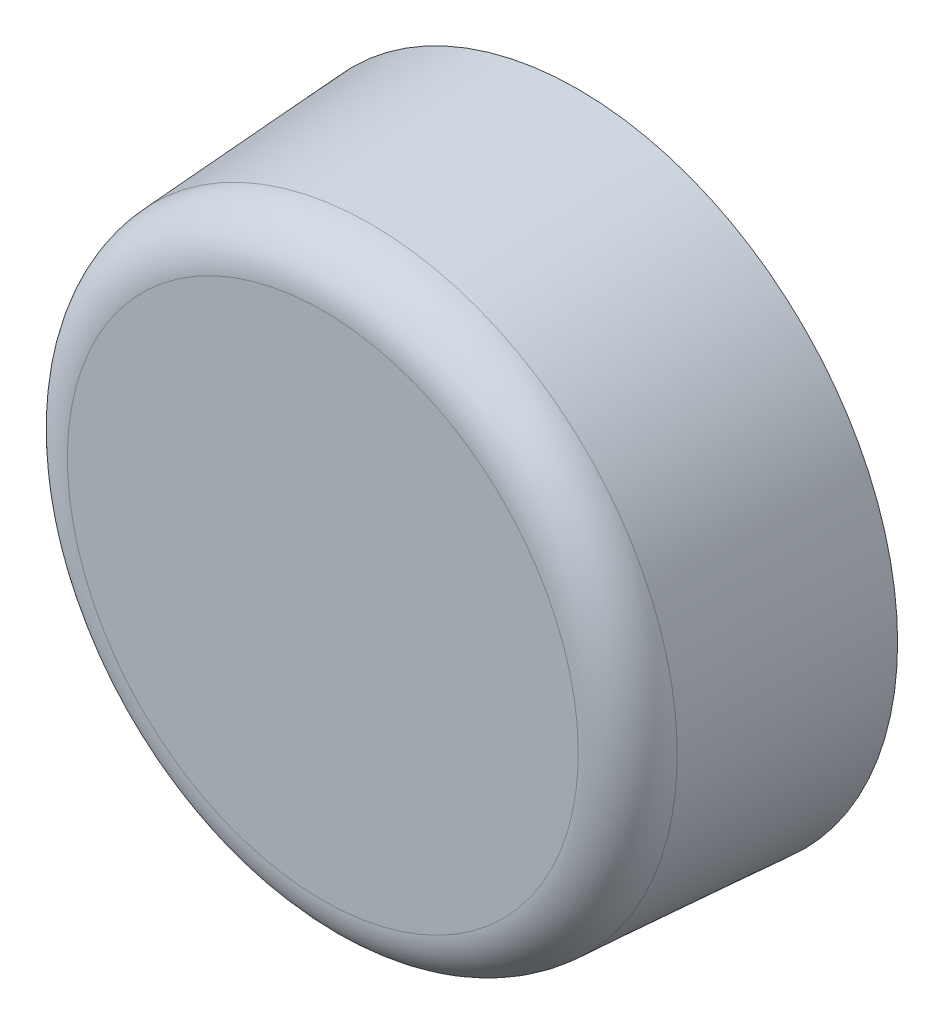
ISO-10303-21;
HEADER;
FILE_DESCRIPTION(('STEP AP214'),'2;1');
FILE_NAME('part.step','',(''),(''),'','','');
FILE_SCHEMA(('AUTOMOTIVE_DESIGN { 1 0 10303 214 1 1 1 1 }'));
ENDSEC;
DATA;
#1=APPLICATION_CONTEXT('core data for automotive mechanical design processes');
#2=APPLICATION_PROTOCOL_DEFINITION('international standard','automotive_design',2000,#1);
#3=PRODUCT_CONTEXT('',#1,'mechanical');
#4=PRODUCT('Part','Part','',(#3));
#5=PRODUCT_RELATED_PRODUCT_CATEGORY('part','',(#4));
#6=PRODUCT_DEFINITION_FORMATION('','',#4);
#7=PRODUCT_DEFINITION_CONTEXT('part definition',#1,'design');
#8=PRODUCT_DEFINITION('design','',#6,#7);
#9=PRODUCT_DEFINITION_SHAPE('','',#8);
#10=(LENGTH_UNIT() NAMED_UNIT(*) SI_UNIT(.MILLI.,.METRE.));
#11=(NAMED_UNIT(*) PLANE_ANGLE_UNIT() SI_UNIT($,.RADIAN.));
#12=(NAMED_UNIT(*) SI_UNIT($,.STERADIAN.) SOLID_ANGLE_UNIT());
#13=UNCERTAINTY_MEASURE_WITH_UNIT(LENGTH_MEASURE(1.E-05),#10,'distance_accuracy_value','');
#14=(GEOMETRIC_REPRESENTATION_CONTEXT(3) GLOBAL_UNCERTAINTY_ASSIGNED_CONTEXT((#13)) GLOBAL_UNIT_ASSIGNED_CONTEXT((#10,
#11,#12)) REPRESENTATION_CONTEXT('',''));
#15=CARTESIAN_POINT('',(0.,0.,0.));
#16=DIRECTION('',(0.,0.,1.));
#17=DIRECTION('',(1.,0.,0.));
#18=AXIS2_PLACEMENT_3D('',#15,#16,#17);
#19=CARTESIAN_POINT('',(0.,0.,20.));
#20=DIRECTION('',(0.,0.,1.));
#21=DIRECTION('',(0.,-1.,0.));
#22=AXIS2_PLACEMENT_3D('',#19,#20,#21);
#23=CYLINDRICAL_SURFACE('',#22,22.5);
#24=CARTESIAN_POINT('',(0.,0.,0.));
#25=DIRECTION('',(0.,0.,1.));
#26=DIRECTION('',(0.,-1.,0.));
#27=AXIS2_PLACEMENT_3D('',#24,#25,#26);
#28=CIRCLE('',#27,22.5);
#29=CARTESIAN_POINT('',(0.,-22.5,0.));
#30=VERTEX_POINT('',#29);
#31=EDGE_CURVE('E27',#30,#30,#28,.T.);
#32=ORIENTED_EDGE('',*,*,#31,.F.);
#33=EDGE_LOOP('',(#32));
#34=FACE_BOUND('',#33,.T.);
#35=CARTESIAN_POINT('',(0.,0.,0.0500000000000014));
#36=DIRECTION('',(0.,0.,1.));
#37=DIRECTION('',(0.,-1.,0.));
#38=AXIS2_PLACEMENT_3D('',#35,#36,#37);
#39=CIRCLE('',#38,22.5);
#40=CARTESIAN_POINT('',(0.,-22.5,0.0500000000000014));
#41=VERTEX_POINT('',#40);
#42=EDGE_CURVE('E44',#41,#41,#39,.T.);
#43=ORIENTED_EDGE('',*,*,#42,.T.);
#44=EDGE_LOOP('',(#43));
#45=FACE_BOUND('',#44,.T.);
#46=ADVANCED_FACE('F12',(#34,#45),#23,.F.);
#47=CARTESIAN_POINT('',(22.5,0.,0.));
#48=DIRECTION('',(0.,0.,1.));
#49=DIRECTION('',(0.,-1.,0.));
#50=AXIS2_PLACEMENT_3D('',#47,#48,#49);
#51=PLANE('',#50);
#52=CARTESIAN_POINT('',(0.,0.,0.));
#53=DIRECTION('',(0.,0.,1.));
#54=DIRECTION('',(0.,-1.,0.));
#55=AXIS2_PLACEMENT_3D('',#52,#53,#54);
#56=CIRCLE('',#55,25.);
#57=CARTESIAN_POINT('',(0.,-25.,0.));
#58=VERTEX_POINT('',#57);
#59=EDGE_CURVE('E32',#58,#58,#56,.T.);
#60=ORIENTED_EDGE('',*,*,#59,.F.);
#61=EDGE_LOOP('',(#60));
#62=FACE_BOUND('',#61,.T.);
#63=ORIENTED_EDGE('',*,*,#31,.T.);
#64=EDGE_LOOP('',(#63));
#65=FACE_BOUND('',#64,.T.);
#66=ADVANCED_FACE('F72',(#62,#65),#51,.F.);
#67=CARTESIAN_POINT('',(0.,0.,0.));
#68=DIRECTION('',(0.,0.,-1.));
#69=DIRECTION('',(0.,1.,0.));
#70=AXIS2_PLACEMENT_3D('',#67,#68,#69);
#71=CONICAL_SURFACE('',#70,25.,0.0619403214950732);
#72=CARTESIAN_POINT('',(0.,0.,16.2476028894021));
#73=DIRECTION('',(0.,0.,1.));
#74=DIRECTION('',(0.,-1.,0.));
#75=AXIS2_PLACEMENT_3D('',#72,#73,#74);
#76=CIRCLE('',#75,23.9923292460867);
#77=CARTESIAN_POINT('',(0.,-23.9923292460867,16.2476028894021));
#78=VERTEX_POINT('',#77);
#79=EDGE_CURVE('E35',#78,#78,#76,.T.);
#80=ORIENTED_EDGE('',*,*,#79,.F.);
#81=EDGE_LOOP('',(#80));
#82=FACE_BOUND('',#81,.T.);
#83=ORIENTED_EDGE('',*,*,#59,.T.);
#84=EDGE_LOOP('',(#83));
#85=FACE_BOUND('',#84,.T.);
#86=ADVANCED_FACE('F77',(#82,#85),#71,.T.);
#87=CARTESIAN_POINT('',(0.,0.,16.));
#88=DIRECTION('',(0.,0.,1.));
#89=DIRECTION('',(0.,-1.,0.));
#90=AXIS2_PLACEMENT_3D('',#87,#88,#89);
#91=TOROIDAL_SURFACE('',#90,20.,4.);
#92=ORIENTED_EDGE('',*,*,#79,.T.);
#93=EDGE_LOOP('',(#92));
#94=FACE_BOUND('',#93,.T.);
#95=CARTESIAN_POINT('',(0.,0.,20.));
#96=DIRECTION('',(0.,0.,1.));
#97=DIRECTION('',(0.,-1.,0.));
#98=AXIS2_PLACEMENT_3D('',#95,#96,#97);
#99=CIRCLE('',#98,20.);
#100=CARTESIAN_POINT('',(0.,-20.,20.));
#101=VERTEX_POINT('',#100);
#102=EDGE_CURVE('E38',#101,#101,#99,.T.);
#103=ORIENTED_EDGE('',*,*,#102,.F.);
#104=EDGE_LOOP('',(#103));
#105=FACE_BOUND('',#104,.T.);
#106=ADVANCED_FACE('F84',(#94,#105),#91,.T.);
#107=CARTESIAN_POINT('',(20.,0.,20.));
#108=DIRECTION('',(0.,0.,-1.));
#109=DIRECTION('',(0.,1.,0.));
#110=AXIS2_PLACEMENT_3D('',#107,#108,#109);
#111=PLANE('',#110);
#112=ORIENTED_EDGE('',*,*,#102,.T.);
#113=EDGE_LOOP('',(#112));
#114=FACE_BOUND('',#113,.T.);
#115=ADVANCED_FACE('F59',(#114),#111,.F.);
#116=CARTESIAN_POINT('',(0.,0.,0.));
#117=DIRECTION('',(0.,0.,1.));
#118=DIRECTION('',(0.,-1.,0.));
#119=AXIS2_PLACEMENT_3D('',#116,#117,#118);
#120=PLANE('',#119);
#121=CARTESIAN_POINT('',(0.,0.,0.));
#122=DIRECTION('',(0.,0.,1.));
#123=DIRECTION('',(0.,-1.,0.));
#124=AXIS2_PLACEMENT_3D('',#121,#122,#123);
#125=CIRCLE('',#124,22.45);
#126=CARTESIAN_POINT('',(0.,-22.45,0.));
#127=VERTEX_POINT('',#126);
#128=EDGE_CURVE('E41',#127,#127,#125,.T.);
#129=ORIENTED_EDGE('',*,*,#128,.F.);
#130=EDGE_LOOP('',(#129));
#131=FACE_BOUND('',#130,.T.);
#132=CARTESIAN_POINT('',(0.,0.,0.));
#133=DIRECTION('',(0.,0.,1.));
#134=DIRECTION('',(0.,-1.,0.));
#135=AXIS2_PLACEMENT_3D('',#132,#133,#134);
#136=CIRCLE('',#135,5.);
#137=CARTESIAN_POINT('',(0.,-5.,0.));
#138=VERTEX_POINT('',#137);
#139=EDGE_CURVE('E23',#138,#138,#136,.T.);
#140=ORIENTED_EDGE('',*,*,#139,.T.);
#141=EDGE_LOOP('',(#140));
#142=FACE_BOUND('',#141,.T.);
#143=ADVANCED_FACE('F53',(#131,#142),#120,.F.);
#144=CARTESIAN_POINT('',(0.,0.,0.));
#145=DIRECTION('',(0.,0.,1.));
#146=DIRECTION('',(0.,-1.,0.));
#147=AXIS2_PLACEMENT_3D('',#144,#145,#146);
#148=CONICAL_SURFACE('',#147,22.45,0.785398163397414);
#149=ORIENTED_EDGE('',*,*,#42,.F.);
#150=EDGE_LOOP('',(#149));
#151=FACE_BOUND('',#150,.T.);
#152=ORIENTED_EDGE('',*,*,#128,.T.);
#153=EDGE_LOOP('',(#152));
#154=FACE_BOUND('',#153,.T.);
#155=ADVANCED_FACE('F49',(#151,#154),#148,.T.);
#156=CARTESIAN_POINT('',(0.,0.,20.));
#157=DIRECTION('',(0.,0.,1.));
#158=DIRECTION('',(0.,-1.,0.));
#159=AXIS2_PLACEMENT_3D('',#156,#157,#158);
#160=CYLINDRICAL_SURFACE('',#159,5.);
#161=CARTESIAN_POINT('',(0.,0.,-10.5));
#162=DIRECTION('',(0.,0.,1.));
#163=DIRECTION('',(0.,-1.,0.));
#164=AXIS2_PLACEMENT_3D('',#161,#162,#163);
#165=CIRCLE('',#164,5.);
#166=CARTESIAN_POINT('',(0.,-5.,-10.5));
#167=VERTEX_POINT('',#166);
#168=EDGE_CURVE('E8',#167,#167,#165,.T.);
#169=ORIENTED_EDGE('',*,*,#168,.T.);
#170=EDGE_LOOP('',(#169));
#171=FACE_BOUND('',#170,.T.);
#172=ORIENTED_EDGE('',*,*,#139,.F.);
#173=EDGE_LOOP('',(#172));
#174=FACE_BOUND('',#173,.T.);
#175=ADVANCED_FACE('F52',(#171,#174),#160,.T.);
#176=CARTESIAN_POINT('',(0.,0.,-12.));
#177=DIRECTION('',(0.,0.,1.));
#178=DIRECTION('',(0.,-1.,0.));
#179=AXIS2_PLACEMENT_3D('',#176,#177,#178);
#180=PLANE('',#179);
#181=CARTESIAN_POINT('',(0.,0.,-12.));
#182=DIRECTION('',(0.,0.,1.));
#183=DIRECTION('',(0.,-1.,0.));
#184=AXIS2_PLACEMENT_3D('',#181,#182,#183);
#185=CIRCLE('',#184,3.5);
#186=CARTESIAN_POINT('',(0.,-3.5,-12.));
#187=VERTEX_POINT('',#186);
#188=EDGE_CURVE('E19',#187,#187,#185,.F.);
#189=ORIENTED_EDGE('',*,*,#188,.T.);
#190=EDGE_LOOP('',(#189));
#191=FACE_BOUND('',#190,.T.);
#192=ADVANCED_FACE('F64',(#191),#180,.F.);
#193=CARTESIAN_POINT('',(0.,0.,-12.));
#194=DIRECTION('',(0.,0.,1.));
#195=DIRECTION('',(0.,-1.,0.));
#196=AXIS2_PLACEMENT_3D('',#193,#194,#195);
#197=CONICAL_SURFACE('',#196,3.5,0.785398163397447);
#198=ORIENTED_EDGE('',*,*,#168,.F.);
#199=EDGE_LOOP('',(#198));
#200=FACE_BOUND('',#199,.T.);
#201=ORIENTED_EDGE('',*,*,#188,.F.);
#202=EDGE_LOOP('',(#201));
#203=FACE_BOUND('',#202,.T.);
#204=ADVANCED_FACE('F14',(#200,#203),#197,.T.);
#205=CLOSED_SHELL('',(#46,#66,#86,#106,#115,#143,#155,#175,#192,#204));
#206=MANIFOLD_SOLID_BREP('B1',#205);
#207=ADVANCED_BREP_SHAPE_REPRESENTATION('',(#18,#206),#14);
#208=SHAPE_DEFINITION_REPRESENTATION(#9,#207);
ENDSEC;
END-ISO-10303-21;
